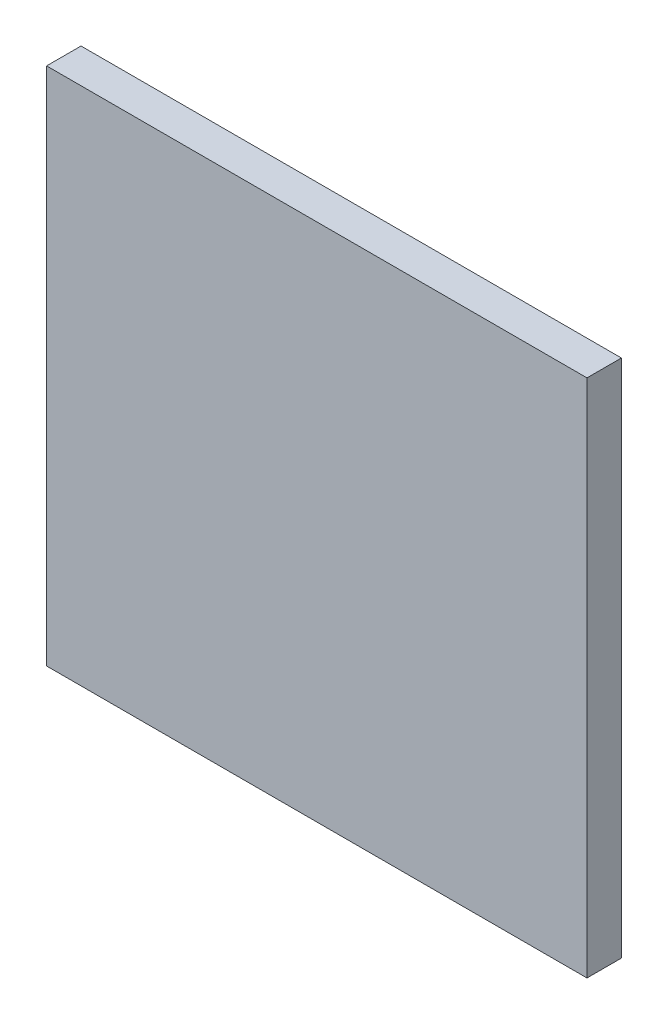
ISO-10303-21;
HEADER;
FILE_DESCRIPTION(('STEP AP214'),'2;1');
FILE_NAME('part.step','',(''),(''),'','','');
FILE_SCHEMA(('AUTOMOTIVE_DESIGN { 1 0 10303 214 1 1 1 1 }'));
ENDSEC;
DATA;
#1=APPLICATION_CONTEXT('core data for automotive mechanical design processes');
#2=APPLICATION_PROTOCOL_DEFINITION('international standard','automotive_design',2000,#1);
#3=PRODUCT_CONTEXT('',#1,'mechanical');
#4=PRODUCT('Part','Part','',(#3));
#5=PRODUCT_RELATED_PRODUCT_CATEGORY('part','',(#4));
#6=PRODUCT_DEFINITION_FORMATION('','',#4);
#7=PRODUCT_DEFINITION_CONTEXT('part definition',#1,'design');
#8=PRODUCT_DEFINITION('design','',#6,#7);
#9=PRODUCT_DEFINITION_SHAPE('','',#8);
#10=(LENGTH_UNIT() NAMED_UNIT(*) SI_UNIT(.MILLI.,.METRE.));
#11=(NAMED_UNIT(*) PLANE_ANGLE_UNIT() SI_UNIT($,.RADIAN.));
#12=(NAMED_UNIT(*) SI_UNIT($,.STERADIAN.) SOLID_ANGLE_UNIT());
#13=UNCERTAINTY_MEASURE_WITH_UNIT(LENGTH_MEASURE(1.E-05),#10,'distance_accuracy_value','');
#14=(GEOMETRIC_REPRESENTATION_CONTEXT(3) GLOBAL_UNCERTAINTY_ASSIGNED_CONTEXT((#13)) GLOBAL_UNIT_ASSIGNED_CONTEXT((#10,
#11,#12)) REPRESENTATION_CONTEXT('',''));
#15=CARTESIAN_POINT('',(0.,0.,0.));
#16=DIRECTION('',(0.,0.,1.));
#17=DIRECTION('',(1.,0.,0.));
#18=AXIS2_PLACEMENT_3D('',#15,#16,#17);
#19=CARTESIAN_POINT('',(-45.69437270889,37.1040600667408,10.));
#20=DIRECTION('',(1.,0.,0.));
#21=DIRECTION('',(0.,1.,0.));
#22=AXIS2_PLACEMENT_3D('',#19,#20,#21);
#23=PLANE('',#22);
#24=DIRECTION('',(0.,-1.,0.));
#25=VECTOR('',#24,1.);
#26=CARTESIAN_POINT('',(-45.69437270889,37.1040600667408,0.));
#27=LINE('',#26,#25);
#28=CARTESIAN_POINT('',(-45.69437270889,37.1040600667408,0.));
#29=VERTEX_POINT('',#28);
#30=CARTESIAN_POINT('',(-45.69437270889,-113.895939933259,0.));
#31=VERTEX_POINT('',#30);
#32=EDGE_CURVE('E93',#29,#31,#27,.T.);
#33=ORIENTED_EDGE('',*,*,#32,.T.);
#34=DIRECTION('',(0.,0.,-1.));
#35=VECTOR('',#34,1.);
#36=CARTESIAN_POINT('',(-45.69437270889,-113.895939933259,10.));
#37=LINE('',#36,#35);
#38=CARTESIAN_POINT('',(-45.69437270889,-113.895939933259,10.));
#39=VERTEX_POINT('',#38);
#40=EDGE_CURVE('E11',#39,#31,#37,.T.);
#41=ORIENTED_EDGE('',*,*,#40,.F.);
#42=DIRECTION('',(0.,-1.,0.));
#43=VECTOR('',#42,1.);
#44=CARTESIAN_POINT('',(-45.69437270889,37.1040600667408,10.));
#45=LINE('',#44,#43);
#46=CARTESIAN_POINT('',(-45.69437270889,37.1040600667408,10.));
#47=VERTEX_POINT('',#46);
#48=EDGE_CURVE('E81',#47,#39,#45,.T.);
#49=ORIENTED_EDGE('',*,*,#48,.F.);
#50=DIRECTION('',(0.,0.,-1.));
#51=VECTOR('',#50,1.);
#52=CARTESIAN_POINT('',(-45.69437270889,37.1040600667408,10.));
#53=LINE('',#52,#51);
#54=EDGE_CURVE('E89',#47,#29,#53,.T.);
#55=ORIENTED_EDGE('',*,*,#54,.T.);
#56=EDGE_LOOP('',(#33,#41,#49,#55));
#57=FACE_BOUND('',#56,.T.);
#58=ADVANCED_FACE('F30',(#57),#23,.F.);
#59=CARTESIAN_POINT('',(-45.69437270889,-113.895939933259,10.));
#60=DIRECTION('',(0.,1.,0.));
#61=DIRECTION('',(0.,0.,1.));
#62=AXIS2_PLACEMENT_3D('',#59,#60,#61);
#63=PLANE('',#62);
#64=DIRECTION('',(1.,0.,0.));
#65=VECTOR('',#64,1.);
#66=CARTESIAN_POINT('',(-45.69437270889,-113.895939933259,0.));
#67=LINE('',#66,#65);
#68=CARTESIAN_POINT('',(111.30562729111,-113.895939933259,0.));
#69=VERTEX_POINT('',#68);
#70=EDGE_CURVE('E85',#31,#69,#67,.T.);
#71=ORIENTED_EDGE('',*,*,#70,.T.);
#72=DIRECTION('',(0.,0.,-1.));
#73=VECTOR('',#72,1.);
#74=CARTESIAN_POINT('',(111.30562729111,-113.895939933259,10.));
#75=LINE('',#74,#73);
#76=CARTESIAN_POINT('',(111.30562729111,-113.895939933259,10.));
#77=VERTEX_POINT('',#76);
#78=EDGE_CURVE('E38',#77,#69,#75,.T.);
#79=ORIENTED_EDGE('',*,*,#78,.F.);
#80=DIRECTION('',(1.,0.,0.));
#81=VECTOR('',#80,1.);
#82=CARTESIAN_POINT('',(-45.69437270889,-113.895939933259,10.));
#83=LINE('',#82,#81);
#84=EDGE_CURVE('E76',#39,#77,#83,.T.);
#85=ORIENTED_EDGE('',*,*,#84,.F.);
#86=ORIENTED_EDGE('',*,*,#40,.T.);
#87=EDGE_LOOP('',(#71,#79,#85,#86));
#88=FACE_BOUND('',#87,.T.);
#89=ADVANCED_FACE('F84',(#88),#63,.F.);
#90=CARTESIAN_POINT('',(111.30562729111,37.1040600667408,10.));
#91=DIRECTION('',(-1.,0.,0.));
#92=DIRECTION('',(0.,-1.,0.));
#93=AXIS2_PLACEMENT_3D('',#90,#91,#92);
#94=PLANE('',#93);
#95=DIRECTION('',(0.,1.,0.));
#96=VECTOR('',#95,1.);
#97=CARTESIAN_POINT('',(111.30562729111,37.1040600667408,0.));
#98=LINE('',#97,#96);
#99=CARTESIAN_POINT('',(111.30562729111,37.1040600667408,0.));
#100=VERTEX_POINT('',#99);
#101=EDGE_CURVE('E63',#69,#100,#98,.T.);
#102=ORIENTED_EDGE('',*,*,#101,.T.);
#103=DIRECTION('',(0.,0.,-1.));
#104=VECTOR('',#103,1.);
#105=CARTESIAN_POINT('',(111.30562729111,37.1040600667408,10.));
#106=LINE('',#105,#104);
#107=CARTESIAN_POINT('',(111.30562729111,37.1040600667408,10.));
#108=VERTEX_POINT('',#107);
#109=EDGE_CURVE('E86',#108,#100,#106,.T.);
#110=ORIENTED_EDGE('',*,*,#109,.F.);
#111=DIRECTION('',(0.,1.,0.));
#112=VECTOR('',#111,1.);
#113=CARTESIAN_POINT('',(111.30562729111,37.1040600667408,10.));
#114=LINE('',#113,#112);
#115=EDGE_CURVE('E79',#77,#108,#114,.T.);
#116=ORIENTED_EDGE('',*,*,#115,.F.);
#117=ORIENTED_EDGE('',*,*,#78,.T.);
#118=EDGE_LOOP('',(#102,#110,#116,#117));
#119=FACE_BOUND('',#118,.T.);
#120=ADVANCED_FACE('F87',(#119),#94,.F.);
#121=CARTESIAN_POINT('',(-45.69437270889,37.1040600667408,10.));
#122=DIRECTION('',(0.,-1.,0.));
#123=DIRECTION('',(0.,0.,-1.));
#124=AXIS2_PLACEMENT_3D('',#121,#122,#123);
#125=PLANE('',#124);
#126=DIRECTION('',(-1.,0.,0.));
#127=VECTOR('',#126,1.);
#128=CARTESIAN_POINT('',(-45.69437270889,37.1040600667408,0.));
#129=LINE('',#128,#127);
#130=EDGE_CURVE('E69',#100,#29,#129,.T.);
#131=ORIENTED_EDGE('',*,*,#130,.T.);
#132=ORIENTED_EDGE('',*,*,#54,.F.);
#133=DIRECTION('',(-1.,0.,0.));
#134=VECTOR('',#133,1.);
#135=CARTESIAN_POINT('',(-45.69437270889,37.1040600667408,10.));
#136=LINE('',#135,#134);
#137=EDGE_CURVE('E46',#108,#47,#136,.T.);
#138=ORIENTED_EDGE('',*,*,#137,.F.);
#139=ORIENTED_EDGE('',*,*,#109,.T.);
#140=EDGE_LOOP('',(#131,#132,#138,#139));
#141=FACE_BOUND('',#140,.T.);
#142=ADVANCED_FACE('F100',(#141),#125,.F.);
#143=CARTESIAN_POINT('',(-45.69437270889,-113.895939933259,10.));
#144=DIRECTION('',(0.,0.,1.));
#145=DIRECTION('',(1.,0.,0.));
#146=AXIS2_PLACEMENT_3D('',#143,#144,#145);
#147=PLANE('',#146);
#148=ORIENTED_EDGE('',*,*,#48,.T.);
#149=ORIENTED_EDGE('',*,*,#84,.T.);
#150=ORIENTED_EDGE('',*,*,#115,.T.);
#151=ORIENTED_EDGE('',*,*,#137,.T.);
#152=EDGE_LOOP('',(#148,#149,#150,#151));
#153=FACE_BOUND('',#152,.T.);
#154=ADVANCED_FACE('F77',(#153),#147,.T.);
#155=CARTESIAN_POINT('',(-45.69437270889,-113.895939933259,0.));
#156=DIRECTION('',(0.,0.,1.));
#157=DIRECTION('',(1.,0.,0.));
#158=AXIS2_PLACEMENT_3D('',#155,#156,#157);
#159=PLANE('',#158);
#160=ORIENTED_EDGE('',*,*,#32,.F.);
#161=ORIENTED_EDGE('',*,*,#130,.F.);
#162=ORIENTED_EDGE('',*,*,#101,.F.);
#163=ORIENTED_EDGE('',*,*,#70,.F.);
#164=EDGE_LOOP('',(#160,#161,#162,#163));
#165=FACE_BOUND('',#164,.T.);
#166=ADVANCED_FACE('F103',(#165),#159,.F.);
#167=CLOSED_SHELL('',(#58,#89,#120,#142,#154,#166));
#168=MANIFOLD_SOLID_BREP('B2',#167);
#169=ADVANCED_BREP_SHAPE_REPRESENTATION('',(#18,#168),#14);
#170=SHAPE_DEFINITION_REPRESENTATION(#9,#169);
ENDSEC;
END-ISO-10303-21;
